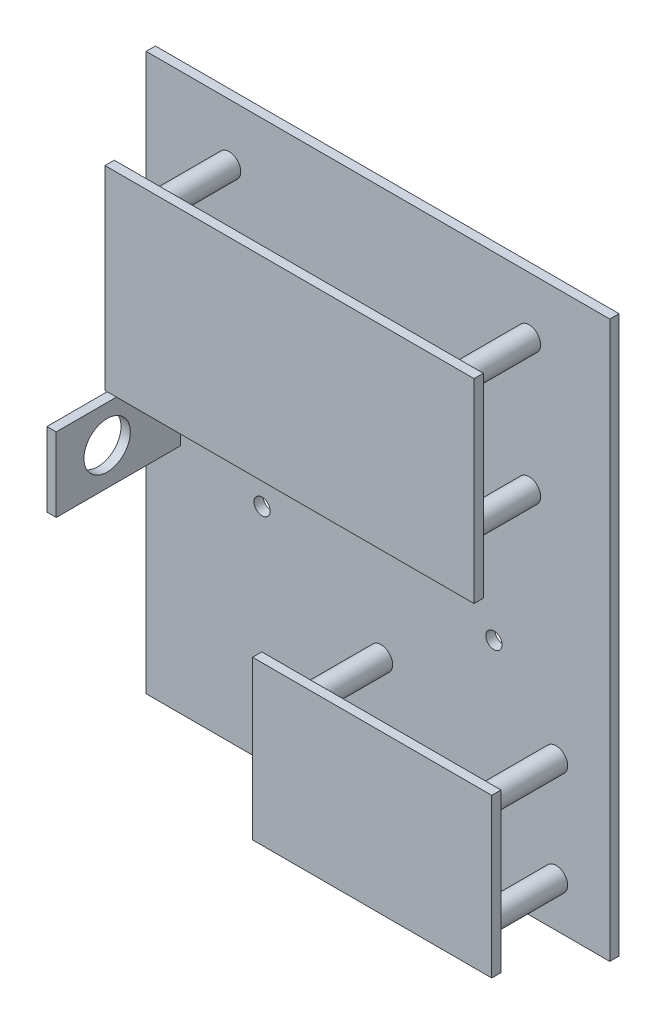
from build123d import *

# Parameters (mm, degrees)
ESQUISSE1_W             = 100
ESQUISSE1_H             = 120
BOSS_EXTRU_1_DEPTH      = 2
ESQUISSE2_R             = 2.5
BOSS_EXTRU_2_DEPTH      = 18
ESQUISSE5_W             = 79.605469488
ESQUISSE5_H             = 42.012822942
ESQUISSE5_W_2           = 51.585667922
ESQUISSE5_H_2           = 34.123671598
BOSS_EXTRU_4_DEPTH      = 2
EXTRU_MINCE1_START      = 50
EXTRU_MINCE1_DEPTH      = 16
ESQUISSE9_R             = 5
ENL_V_MAT_EXTRU_2_DEPTH = 16
ESQUISSE4_R             = 1.75
ENL_V_MAT_EXTRU_3_DEPTH = 10


with BuildPart() as part:
    # Esquisse1 → Boss.-Extru.1 (new body)
    with BuildSketch(Plane.XY):
        with Locations((50, 60)):
            Rectangle(ESQUISSE1_W, ESQUISSE1_H)
    extrude(amount=BOSS_EXTRU_1_DEPTH)

    # Esquisse2 → Boss.-Extru.2 (add)
    with BuildSketch(Plane.XY.offset(2)):
        with Locations(Location((17.903866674, 107.720533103, 0), (0, 0, 180))):
            Circle(ESQUISSE2_R)
        with Locations(Location((82.584842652, 107.720533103, 0), (0, 0, 180))):
            Circle(ESQUISSE2_R)
        with Locations(Location((82.584842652, 79.350357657, 0), (0, 0, 180))):
            Circle(ESQUISSE2_R)
        with Locations(Location((17.903866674, 79.350357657, 0), (0, 0, 180))):
            Circle(ESQUISSE2_R)
        with Locations(Location((50.665886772, 31.999141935, 0), (0, 0, 180))):
            Circle(ESQUISSE2_R)
        with Locations(Location((88.418961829, 31.999141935, 0), (0, 0, 180))):
            Circle(ESQUISSE2_R)
        with Locations(Location((88.418961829, 9.659365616, 0), (0, 0, 180))):
            Circle(ESQUISSE2_R)
        with Locations(Location((50.665886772, 9.659365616, 0), (0, 0, 180))):
            Circle(ESQUISSE2_R)
    extrude(amount=BOSS_EXTRU_2_DEPTH)

    # Esquisse5 → Boss.-Extru.4 (add)
    with BuildSketch(Plane.XY.offset(20)):
        with Locations((50.92279598, 93.225076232)):
            Rectangle(ESQUISSE5_W, ESQUISSE5_H)
        with Locations((68.744597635, 21.237801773)):
            Rectangle(ESQUISSE5_W_2, ESQUISSE5_H_2)
    extrude(amount=BOSS_EXTRU_4_DEPTH)

    # Esquisse6 → Extru.-Mince1 (add)
    with BuildSketch(Plane(origin=(0, 0, 0), x_dir=(1, 0, 0), z_dir=(0, 1, 0)).offset(EXTRU_MINCE1_START)):
        Polygon((0.279042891, -2), (7.37780243, -2), (7.37780243, -28.776459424), (5.37780243, -28.776459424), (5.37780243, -4), (0.279042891, -4), align=None)
    extrude(amount=EXTRU_MINCE1_DEPTH)

    # Esquisse9 → Enl_v. mat.-Extru.2 (cut)
    with BuildSketch(Plane.ZY.offset(-5.37780243)):
        with Locations((17.799952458, 58)):
            Circle(ESQUISSE9_R)
    extrude(amount=-ENL_V_MAT_EXTRU_2_DEPTH, mode=Mode.SUBTRACT)

    # Esquisse4 → Enl_v. mat.-Extru.3 (cut)
    with BuildSketch(Plane(origin=(0, 0, 0), x_dir=(-1, 0, 0), z_dir=(0, 0, -1))):
        with Locations((-75, 72.5)):
            Circle(ESQUISSE4_R)
        with Locations((-75, 47.5)):
            Circle(ESQUISSE4_R)
        with Locations((-25, 47.5)):
            Circle(ESQUISSE4_R)
        with Locations((-25, 72.5)):
            Circle(ESQUISSE4_R)
    extrude(amount=-ENL_V_MAT_EXTRU_3_DEPTH, mode=Mode.SUBTRACT)


solid = part.part
